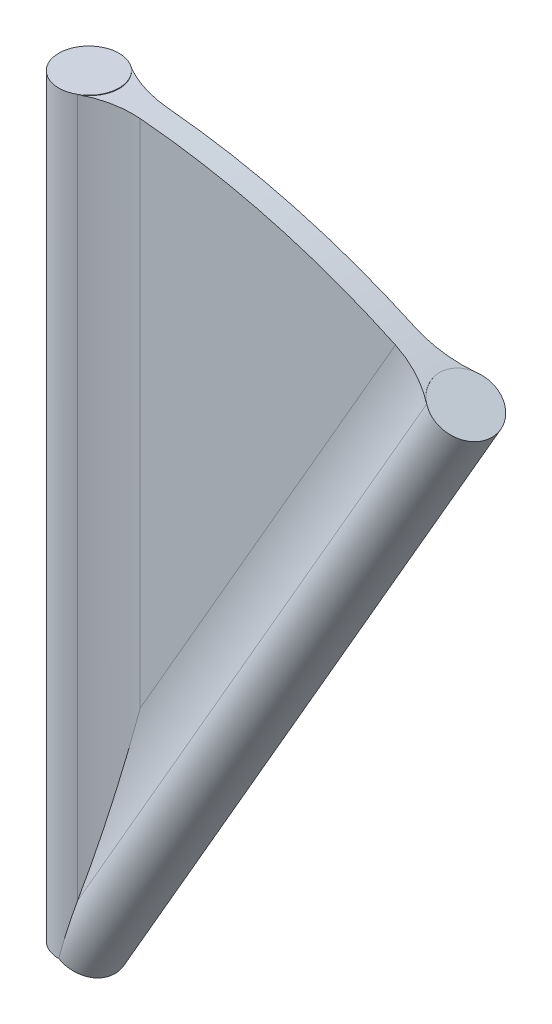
ISO-10303-21;
HEADER;
FILE_DESCRIPTION(('STEP AP214'),'2;1');
FILE_NAME('part.step','',(''),(''),'','','');
FILE_SCHEMA(('AUTOMOTIVE_DESIGN { 1 0 10303 214 1 1 1 1 }'));
ENDSEC;
DATA;
#1=APPLICATION_CONTEXT('core data for automotive mechanical design processes');
#2=APPLICATION_PROTOCOL_DEFINITION('international standard','automotive_design',2000,#1);
#3=PRODUCT_CONTEXT('',#1,'mechanical');
#4=PRODUCT('Part','Part','',(#3));
#5=PRODUCT_RELATED_PRODUCT_CATEGORY('part','',(#4));
#6=PRODUCT_DEFINITION_FORMATION('','',#4);
#7=PRODUCT_DEFINITION_CONTEXT('part definition',#1,'design');
#8=PRODUCT_DEFINITION('design','',#6,#7);
#9=PRODUCT_DEFINITION_SHAPE('','',#8);
#10=(LENGTH_UNIT() NAMED_UNIT(*) SI_UNIT(.MILLI.,.METRE.));
#11=(NAMED_UNIT(*) PLANE_ANGLE_UNIT() SI_UNIT($,.RADIAN.));
#12=(NAMED_UNIT(*) SI_UNIT($,.STERADIAN.) SOLID_ANGLE_UNIT());
#13=UNCERTAINTY_MEASURE_WITH_UNIT(LENGTH_MEASURE(1.E-05),#10,'distance_accuracy_value','');
#14=(GEOMETRIC_REPRESENTATION_CONTEXT(3) GLOBAL_UNCERTAINTY_ASSIGNED_CONTEXT((#13)) GLOBAL_UNIT_ASSIGNED_CONTEXT((#10,
#11,#12)) REPRESENTATION_CONTEXT('',''));
#15=CARTESIAN_POINT('',(0.,0.,0.));
#16=DIRECTION('',(0.,0.,1.));
#17=DIRECTION('',(1.,0.,0.));
#18=AXIS2_PLACEMENT_3D('',#15,#16,#17);
#19=CARTESIAN_POINT('',(0.,19.05,0.));
#20=DIRECTION('',(0.,-1.,0.));
#21=DIRECTION('',(0.,0.,-1.));
#22=AXIS2_PLACEMENT_3D('',#19,#20,#21);
#23=CYLINDRICAL_SURFACE('',#22,0.762);
#24=CARTESIAN_POINT('',(0.,19.05,0.));
#25=DIRECTION('',(0.,1.,0.));
#26=DIRECTION('',(0.,0.,1.));
#27=AXIS2_PLACEMENT_3D('',#24,#25,#26);
#28=CIRCLE('',#27,0.762);
#29=CARTESIAN_POINT('',(0.,19.05,0.762));
#30=VERTEX_POINT('',#29);
#31=EDGE_CURVE('E98',#30,#30,#28,.T.);
#32=ORIENTED_EDGE('',*,*,#31,.F.);
#33=EDGE_LOOP('',(#32));
#34=FACE_BOUND('',#33,.T.);
#35=CARTESIAN_POINT('',(0.,19.05,-0.762));
#36=CARTESIAN_POINT('',(0.0427835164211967,19.0499997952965,-0.76199810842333));
#37=CARTESIAN_POINT('',(0.0855976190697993,19.0498543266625,-0.758384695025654));
#38=CARTESIAN_POINT('',(0.170045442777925,19.0492880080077,-0.744020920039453));
#39=CARTESIAN_POINT('',(0.211677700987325,19.0488668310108,-0.73326208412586));
#40=CARTESIAN_POINT('',(0.292526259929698,19.0477967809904,-0.704915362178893));
#41=CARTESIAN_POINT('',(0.331743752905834,19.0471480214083,-0.687330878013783));
#42=CARTESIAN_POINT('',(0.40665943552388,19.0456959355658,-0.645837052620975));
#43=CARTESIAN_POINT('',(0.442358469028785,19.0448926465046,-0.621929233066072));
#44=CARTESIAN_POINT('',(0.509259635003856,19.0432212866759,-0.568448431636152));
#45=CARTESIAN_POINT('',(0.540459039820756,19.0423531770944,-0.538872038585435));
#46=CARTESIAN_POINT('',(0.597452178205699,19.0406503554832,-0.474900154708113));
#47=CARTESIAN_POINT('',(0.623245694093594,19.0398156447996,-0.440504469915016));
#48=CARTESIAN_POINT('',(0.668701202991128,19.0382735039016,-0.367857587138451));
#49=CARTESIAN_POINT('',(0.688361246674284,19.0375661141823,-0.329605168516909));
#50=CARTESIAN_POINT('',(0.720979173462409,19.0363588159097,-0.250339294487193));
#51=CARTESIAN_POINT('',(0.733937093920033,19.0358589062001,-0.20932585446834));
#52=CARTESIAN_POINT('',(0.752776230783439,19.0351232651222,-0.125725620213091));
#53=CARTESIAN_POINT('',(0.758661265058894,19.0348873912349,-0.0831396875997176));
#54=CARTESIAN_POINT('',(0.7631993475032,19.0347059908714,0.00241623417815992));
#55=CARTESIAN_POINT('',(0.761852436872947,19.0347604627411,0.0453862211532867));
#56=CARTESIAN_POINT('',(0.751968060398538,19.0351534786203,0.130464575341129));
#57=CARTESIAN_POINT('',(0.743434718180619,19.0354918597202,0.172573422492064));
#58=CARTESIAN_POINT('',(0.719426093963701,19.0364142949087,0.254760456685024));
#59=CARTESIAN_POINT('',(0.703950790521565,19.0369983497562,0.294838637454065));
#60=CARTESIAN_POINT('',(0.666492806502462,19.0383464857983,0.37183995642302));
#61=CARTESIAN_POINT('',(0.644508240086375,19.0391106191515,0.408762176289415));
#62=CARTESIAN_POINT('',(0.59465717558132,19.0407327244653,0.478393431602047));
#63=CARTESIAN_POINT('',(0.566790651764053,19.0415906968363,0.511102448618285));
#64=CARTESIAN_POINT('',(0.505943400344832,19.0433044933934,0.571402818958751));
#65=CARTESIAN_POINT('',(0.472959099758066,19.0441603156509,0.598990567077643));
#66=CARTESIAN_POINT('',(0.402825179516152,19.0457727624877,0.648237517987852));
#67=CARTESIAN_POINT('',(0.365675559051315,19.0465293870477,0.669896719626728));
#68=CARTESIAN_POINT('',(0.288263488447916,19.0478581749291,0.706671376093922));
#69=CARTESIAN_POINT('',(0.2480009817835,19.0484303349,0.721786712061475));
#70=CARTESIAN_POINT('',(0.165506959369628,19.0493256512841,0.745042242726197));
#71=CARTESIAN_POINT('',(0.123275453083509,19.049648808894,0.753182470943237));
#72=CARTESIAN_POINT('',(0.0380735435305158,19.0500095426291,0.762252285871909));
#73=CARTESIAN_POINT('',(-0.00489632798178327,19.0500473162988,0.763186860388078));
#74=CARTESIAN_POINT('',(-0.0903827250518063,19.0498335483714,0.757831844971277));
#75=CARTESIAN_POINT('',(-0.132899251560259,19.049582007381,0.751542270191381));
#76=CARTESIAN_POINT('',(-0.216258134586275,19.0488180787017,0.731921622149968));
#77=CARTESIAN_POINT('',(-0.257101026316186,19.0483057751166,0.718592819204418));
#78=CARTESIAN_POINT('',(-0.335969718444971,19.0470780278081,0.685274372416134));
#79=CARTESIAN_POINT('',(-0.373995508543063,19.0463625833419,0.665284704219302));
#80=CARTESIAN_POINT('',(-0.446173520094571,19.0448086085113,0.619199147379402));
#81=CARTESIAN_POINT('',(-0.480323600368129,19.0439700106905,0.593099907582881));
#82=CARTESIAN_POINT('',(-0.543759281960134,19.0422644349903,0.535540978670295));
#83=CARTESIAN_POINT('',(-0.573044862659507,19.0413974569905,0.504081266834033));
#84=CARTESIAN_POINT('',(-0.625936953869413,19.0397322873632,0.436673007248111));
#85=CARTESIAN_POINT('',(-0.649540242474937,19.038934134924,0.400721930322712));
#86=CARTESIAN_POINT('',(-0.690375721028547,19.0374972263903,0.3253642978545));
#87=CARTESIAN_POINT('',(-0.70760793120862,19.0368584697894,0.285957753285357));
#88=CARTESIAN_POINT('',(-0.735206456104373,19.0358126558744,0.204819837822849));
#89=CARTESIAN_POINT('',(-0.74557484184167,19.0354055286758,0.163089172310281));
#90=CARTESIAN_POINT('',(-0.75915817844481,19.0348686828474,0.0784776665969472));
#91=CARTESIAN_POINT('',(-0.762373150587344,19.0347389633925,0.0355968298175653));
#92=CARTESIAN_POINT('',(-0.761558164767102,19.0347715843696,-0.0500656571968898));
#93=CARTESIAN_POINT('',(-0.757533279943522,19.0349337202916,-0.0928473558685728));
#94=CARTESIAN_POINT('',(-0.74236329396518,19.0355313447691,-0.177127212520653));
#95=CARTESIAN_POINT('',(-0.731218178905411,19.0359668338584,-0.218625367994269));
#96=CARTESIAN_POINT('',(-0.702125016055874,19.0370620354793,-0.299161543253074));
#97=CARTESIAN_POINT('',(-0.684176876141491,19.0377217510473,-0.338199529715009));
#98=CARTESIAN_POINT('',(-0.641988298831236,19.0391910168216,-0.412707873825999));
#99=CARTESIAN_POINT('',(-0.617748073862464,19.0400005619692,-0.448178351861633));
#100=CARTESIAN_POINT('',(-0.563646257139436,19.0416788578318,-0.514569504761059));
#101=CARTESIAN_POINT('',(-0.533781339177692,19.0425476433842,-0.545487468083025));
#102=CARTESIAN_POINT('',(-0.46927613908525,19.0442463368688,-0.601879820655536));
#103=CARTESIAN_POINT('',(-0.434634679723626,19.0450762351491,-0.627352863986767));
#104=CARTESIAN_POINT('',(-0.361540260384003,19.0466040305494,-0.672139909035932));
#105=CARTESIAN_POINT('',(-0.323084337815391,19.0473018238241,-0.691449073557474));
#106=CARTESIAN_POINT('',(-0.243502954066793,19.0484850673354,-0.723314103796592));
#107=CARTESIAN_POINT('',(-0.202380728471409,19.0489707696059,-0.73587798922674));
#108=CARTESIAN_POINT('',(-0.13416715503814,19.0495458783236,-0.750581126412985));
#109=CARTESIAN_POINT('',(-0.10751817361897,19.0497154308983,-0.754857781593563));
#110=CARTESIAN_POINT('',(-0.0539168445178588,19.0499425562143,-0.760567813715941));
#111=CARTESIAN_POINT('',(-0.0269644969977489,19.0500001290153,-0.76200119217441));
#112=CARTESIAN_POINT('',(0.,19.05,-0.762));
#113=B_SPLINE_CURVE_WITH_KNOTS('',3,(#35,#36,#37,#38,#39,#40,#41,#42,#43,#44,#45,#46,#47,#48,
#49,#50,#51,#52,#53,#54,#55,#56,#57,#58,#59,#60,#61,#62,#63,#64,#65,#66,#67,#68,#69,#70,#71,#72,
#73,#74,#75,#76,#77,#78,#79,#80,#81,#82,#83,#84,#85,#86,#87,#88,#89,#90,#91,#92,#93,#94,#95,#96,
#97,#98,#99,#100,#101,#102,#103,#104,#105,#106,#107,#108,#109,#110,#111,#112),.UNSPECIFIED.,.T.,
.F.,(4,2,2,2,2,2,2,2,2,2,2,2,2,2,2,2,2,2,2,2,2,2,2,2,2,2,2,2,2,2,2,2,2,2,2,2,2,2,4),(0.,
0.128252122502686,0.256656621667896,0.384997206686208,0.513306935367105,0.641694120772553,
0.770086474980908,0.898519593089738,1.02695199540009,1.15531504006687,1.28367735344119,
1.4119660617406,1.5402551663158,1.66858147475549,1.79690834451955,1.9253252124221,
2.05374210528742,2.18216133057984,2.31057993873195,2.43890964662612,2.56723908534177,
2.69552716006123,2.8238157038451,2.95217478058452,3.08053440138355,3.20896663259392,
3.3373984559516,3.46579150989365,3.59418418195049,3.72248692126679,3.85078991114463,
3.97909463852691,4.10739503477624,4.23577154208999,4.36417974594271,4.49268847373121,
4.62104407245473,4.70187557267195,4.78270702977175),.UNSPECIFIED.);
#114=CARTESIAN_POINT('',(0.404575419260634,19.0457034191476,-0.645726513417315));
#115=VERTEX_POINT('',#114);
#116=CARTESIAN_POINT('',(0.376045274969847,19.0462880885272,0.662747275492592));
#117=VERTEX_POINT('',#116);
#118=EDGE_CURVE('E51',#115,#117,#113,.T.);
#119=ORIENTED_EDGE('',*,*,#118,.F.);
#120=DIRECTION('',(0.,-1.,0.));
#121=VECTOR('',#120,1.);
#122=CARTESIAN_POINT('',(0.404575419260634,19.05,-0.645726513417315));
#123=LINE('',#122,#121);
#124=CARTESIAN_POINT('',(0.404575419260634,1.50989602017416,-0.645726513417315));
#125=VERTEX_POINT('',#124);
#126=EDGE_CURVE('E103',#115,#125,#123,.T.);
#127=ORIENTED_EDGE('',*,*,#126,.T.);
#128=CARTESIAN_POINT('',(0.,0.,0.));
#129=DIRECTION('',(0.965925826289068,-0.258819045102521,0.));
#130=DIRECTION('',(-0.258819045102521,-0.965925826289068,0.));
#131=AXIS2_PLACEMENT_3D('',#128,#129,#130);
#132=ELLIPSE('',#131,2.94414191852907,0.762);
#133=CARTESIAN_POINT('',(0.,0.,-0.762));
#134=VERTEX_POINT('',#133);
#135=EDGE_CURVE('E99',#134,#125,#132,.T.);
#136=ORIENTED_EDGE('',*,*,#135,.F.);
#137=CARTESIAN_POINT('',(0.,0.,0.));
#138=DIRECTION('',(0.,1.,0.));
#139=DIRECTION('',(0.,0.,1.));
#140=AXIS2_PLACEMENT_3D('',#137,#138,#139);
#141=CIRCLE('',#140,0.762);
#142=CARTESIAN_POINT('',(0.,0.,0.762));
#143=VERTEX_POINT('',#142);
#144=EDGE_CURVE('E91',#134,#143,#141,.T.);
#145=ORIENTED_EDGE('',*,*,#144,.T.);
#146=CARTESIAN_POINT('',(0.376045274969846,1.40342007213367,0.662747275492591));
#147=VERTEX_POINT('',#146);
#148=EDGE_CURVE('E108',#147,#143,#132,.T.);
#149=ORIENTED_EDGE('',*,*,#148,.F.);
#150=DIRECTION('',(0.,-1.,0.));
#151=VECTOR('',#150,1.);
#152=CARTESIAN_POINT('',(0.376045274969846,19.05,0.662747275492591));
#153=LINE('',#152,#151);
#154=EDGE_CURVE('E141',#147,#117,#153,.F.);
#155=ORIENTED_EDGE('',*,*,#154,.T.);
#156=EDGE_LOOP('',(#119,#127,#136,#145,#149,#155));
#157=FACE_BOUND('',#156,.T.);
#158=ADVANCED_FACE('F31',(#34,#157),#23,.T.);
#159=CARTESIAN_POINT('',(9.52500000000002,16.4977839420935,0.));
#160=DIRECTION('',(-0.500000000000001,-0.866025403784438,0.));
#161=DIRECTION('',(0.866025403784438,-0.500000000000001,0.));
#162=AXIS2_PLACEMENT_3D('',#159,#160,#161);
#163=CYLINDRICAL_SURFACE('',#162,0.762);
#164=CARTESIAN_POINT('',(9.52500000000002,16.4977839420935,0.));
#165=DIRECTION('',(0.500000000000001,0.866025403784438,0.));
#166=DIRECTION('',(-0.866025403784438,0.500000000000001,0.));
#167=AXIS2_PLACEMENT_3D('',#164,#165,#166);
#168=CIRCLE('',#167,0.762);
#169=CARTESIAN_POINT('',(8.86508864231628,16.8787839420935,0.));
#170=VERTEX_POINT('',#169);
#171=EDGE_CURVE('E116',#170,#170,#168,.T.);
#172=ORIENTED_EDGE('',*,*,#171,.F.);
#173=EDGE_LOOP('',(#172));
#174=FACE_BOUND('',#173,.T.);
#175=CARTESIAN_POINT('',(10.1772883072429,16.1035804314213,0.));
#176=CARTESIAN_POINT('',(10.1772867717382,16.1035815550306,0.0427835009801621));
#177=CARTESIAN_POINT('',(10.174230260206,16.1055143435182,0.0855975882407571));
#178=CARTESIAN_POINT('',(10.1620742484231,16.1131870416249,0.170045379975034));
#179=CARTESIAN_POINT('',(10.1529675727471,16.1189314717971,0.211677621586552));
#180=CARTESIAN_POINT('',(10.1289539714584,16.1340320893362,0.292526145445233));
#181=CARTESIAN_POINT('',(10.1140499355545,16.1433864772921,0.331743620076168));
#182=CARTESIAN_POINT('',(10.0788416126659,16.1653914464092,0.406659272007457));
#183=CARTESIAN_POINT('',(10.0585386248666,16.1780412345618,0.442358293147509));
#184=CARTESIAN_POINT('',(10.0130587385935,16.2062293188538,0.509259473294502));
#185=CARTESIAN_POINT('',(9.98787890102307,16.2217693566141,0.540458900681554));
#186=CARTESIAN_POINT('',(9.93332894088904,16.2552298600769,0.597452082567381));
#187=CARTESIAN_POINT('',(9.90395864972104,16.2731504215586,0.623245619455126));
#188=CARTESIAN_POINT('',(9.84181539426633,16.3108089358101,0.668701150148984));
#189=CARTESIAN_POINT('',(9.8090413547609,16.3305474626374,0.688361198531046));
#190=CARTESIAN_POINT('',(9.74099840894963,16.3712253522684,0.72097913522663));
#191=CARTESIAN_POINT('',(9.70572951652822,16.3921647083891,0.733937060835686));
#192=CARTESIAN_POINT('',(9.63369715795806,16.4346014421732,0.752776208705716));
#193=CARTESIAN_POINT('',(9.59693450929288,16.4560985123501,0.758661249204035));
#194=CARTESIAN_POINT('',(9.52293155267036,16.4990334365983,0.763199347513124));
#195=CARTESIAN_POINT('',(9.48569124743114,16.5204712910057,0.761852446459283));
#196=CARTESIAN_POINT('',(9.41181483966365,16.5626703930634,0.751968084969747));
#197=CARTESIAN_POINT('',(9.37517840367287,16.5834320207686,0.743434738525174));
#198=CARTESIAN_POINT('',(9.30354135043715,16.623727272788,0.719426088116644));
#199=CARTESIAN_POINT('',(9.26854073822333,16.6432608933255,0.703950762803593));
#200=CARTESIAN_POINT('',(9.20118185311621,16.6805946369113,0.666492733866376));
#201=CARTESIAN_POINT('',(9.1688243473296,16.6983942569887,0.644508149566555));
#202=CARTESIAN_POINT('',(9.10771105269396,16.7318054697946,0.594657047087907));
#203=CARTESIAN_POINT('',(9.07895527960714,16.7474170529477,0.566790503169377));
#204=CARTESIAN_POINT('',(9.02587674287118,16.7760830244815,0.505943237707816));
#205=CARTESIAN_POINT('',(9.00155709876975,16.7891356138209,0.472958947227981));
#206=CARTESIAN_POINT('',(8.95810158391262,16.8123622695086,0.402825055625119));
#207=CARTESIAN_POINT('',(8.93896571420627,16.8225363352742,0.365675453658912));
#208=CARTESIAN_POINT('',(8.9064532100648,16.8397723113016,0.28826338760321));
#209=CARTESIAN_POINT('',(8.89307668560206,16.8468341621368,0.248000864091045));
#210=CARTESIAN_POINT('',(8.87248884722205,16.8576860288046,0.165506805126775));
#211=CARTESIAN_POINT('',(8.86527750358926,16.8614760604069,0.123275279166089));
#212=CARTESIAN_POINT('',(8.85724232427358,16.865698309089,0.0380733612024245));
#213=CARTESIAN_POINT('',(8.85641406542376,16.8661328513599,-0.0048964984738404));
#214=CARTESIAN_POINT('',(8.86115862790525,16.8636406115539,-0.0903828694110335));
#215=CARTESIAN_POINT('',(8.86673143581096,16.860713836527,-0.132899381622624));
#216=CARTESIAN_POINT('',(8.8841056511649,16.8515655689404,-0.216258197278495));
#217=CARTESIAN_POINT('',(8.89590504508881,16.8453451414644,-0.257101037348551));
#218=CARTESIAN_POINT('',(8.92537384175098,16.8297497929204,-0.335969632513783));
#219=CARTESIAN_POINT('',(8.94304326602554,16.8203748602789,-0.373995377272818));
#220=CARTESIAN_POINT('',(8.98373173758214,16.7986783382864,-0.446173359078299));
#221=CARTESIAN_POINT('',(9.00675372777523,16.7863551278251,-0.480323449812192));
#222=CARTESIAN_POINT('',(9.0574540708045,16.759052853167,-0.543759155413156));
#223=CARTESIAN_POINT('',(9.08513244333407,16.7440737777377,-0.573044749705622));
#224=CARTESIAN_POINT('',(9.14434214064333,16.7118114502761,-0.625936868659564));
#225=CARTESIAN_POINT('',(9.17587563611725,16.6945268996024,-0.649540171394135));
#226=CARTESIAN_POINT('',(9.24185541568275,16.6580919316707,-0.69037567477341));
#227=CARTESIAN_POINT('',(9.27630169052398,16.6389415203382,-0.707607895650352));
#228=CARTESIAN_POINT('',(9.34709175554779,16.5992776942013,-0.735206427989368));
#229=CARTESIAN_POINT('',(9.38343496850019,16.5787646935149,-0.745574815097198));
#230=CARTESIAN_POINT('',(9.45697886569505,16.5369235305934,-0.759158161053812));
#231=CARTESIAN_POINT('',(9.49417954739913,16.5155953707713,-0.762373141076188));
#232=CARTESIAN_POINT('',(9.56834915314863,16.4727358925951,-0.761558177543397));
#233=CARTESIAN_POINT('',(9.60531822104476,16.4512047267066,-0.757533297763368));
#234=CARTESIAN_POINT('',(9.67800819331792,16.4085475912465,-0.742363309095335));
#235=CARTESIAN_POINT('',(9.71372909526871,16.3874216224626,-0.731218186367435));
#236=CARTESIAN_POINT('',(9.78292826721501,16.3462056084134,-0.702124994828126));
#237=CARTESIAN_POINT('',(9.81640650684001,16.3261155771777,-0.684176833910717));
#238=CARTESIAN_POINT('',(9.88019834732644,16.2875894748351,-0.641988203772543));
#239=CARTESIAN_POINT('',(9.91051205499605,16.2691533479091,-0.617747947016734));
#240=CARTESIAN_POINT('',(9.96716946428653,16.2345045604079,-0.563646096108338));
#241=CARTESIAN_POINT('',(9.9935108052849,16.2182932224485,-0.533781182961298));
#242=CARTESIAN_POINT('',(10.0414985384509,16.1886258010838,-0.469276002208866));
#243=CARTESIAN_POINT('',(10.0631437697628,16.1751703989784,-0.434634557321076));
#244=CARTESIAN_POINT('',(10.1011662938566,16.1514532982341,-0.361540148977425));
#245=CARTESIAN_POINT('',(10.1175394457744,16.1411941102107,-0.323084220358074));
#246=CARTESIAN_POINT('',(10.1445433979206,16.1242362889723,-0.243502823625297));
#247=CARTESIAN_POINT('',(10.1551810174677,16.1175334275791,-0.202380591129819));
#248=CARTESIAN_POINT('',(10.167626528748,16.1096834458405,-0.134167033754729));
#249=CARTESIAN_POINT('',(10.1712453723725,16.1073981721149,-0.107518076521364));
#250=CARTESIAN_POINT('',(10.1760767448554,16.1043463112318,-0.0539167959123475));
#251=CARTESIAN_POINT('',(10.1772892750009,16.1035797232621,-0.0269644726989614));
#252=CARTESIAN_POINT('',(10.1772883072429,16.1035804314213,0.));
#253=B_SPLINE_CURVE_WITH_KNOTS('',3,(#175,#176,#177,#178,#179,#180,#181,#182,#183,#184,#185,
#186,#187,#188,#189,#190,#191,#192,#193,#194,#195,#196,#197,#198,#199,#200,#201,#202,#203,#204,
#205,#206,#207,#208,#209,#210,#211,#212,#213,#214,#215,#216,#217,#218,#219,#220,#221,#222,#223,
#224,#225,#226,#227,#228,#229,#230,#231,#232,#233,#234,#235,#236,#237,#238,#239,#240,#241,#242,
#243,#244,#245,#246,#247,#248,#249,#250,#251,#252),.UNSPECIFIED.,.T.,.F.,(4,2,2,2,2,2,2,2,2,2,2,
2,2,2,2,2,2,2,2,2,2,2,2,2,2,2,2,2,2,2,2,2,2,2,2,2,2,2,4),(0.,0.128252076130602,
0.256656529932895,0.384997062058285,0.513306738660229,0.641693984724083,0.770086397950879,
0.898519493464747,1.02695187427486,1.15531489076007,1.28367717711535,1.41196603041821,
1.54025527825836,1.66858162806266,1.7969085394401,1.92532534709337,2.05374218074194,
2.18216146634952,2.31058013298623,2.43890980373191,2.56723920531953,2.69552713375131,
2.82381553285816,2.95217463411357,3.08053427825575,3.20896653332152,3.33739838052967,
3.46579137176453,3.59418398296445,3.7224868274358,3.85078992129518,3.97909475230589,
4.10739525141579,4.23577169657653,4.36417983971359,4.49268859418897,4.62104421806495,
4.70187564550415,4.78270702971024),.UNSPECIFIED.);
#254=CARTESIAN_POINT('',(9.19747928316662,16.6825919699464,0.662747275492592));
#255=VERTEX_POINT('',#254);
#256=CARTESIAN_POINT('',(9.17247911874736,16.6963507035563,-0.645726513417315));
#257=VERTEX_POINT('',#256);
#258=EDGE_CURVE('E120',#255,#257,#253,.T.);
#259=ORIENTED_EDGE('',*,*,#258,.F.);
#260=DIRECTION('',(-0.500000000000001,-0.866025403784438,0.));
#261=VECTOR('',#260,1.);
#262=CARTESIAN_POINT('',(9.19933523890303,16.6858065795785,0.662747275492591));
#263=LINE('',#262,#261);
#264=EDGE_CURVE('E134',#255,#147,#263,.T.);
#265=ORIENTED_EDGE('',*,*,#264,.T.);
#266=ORIENTED_EDGE('',*,*,#148,.T.);
#267=CARTESIAN_POINT('',(0.,0.,0.));
#268=DIRECTION('',(0.500000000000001,0.866025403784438,0.));
#269=DIRECTION('',(-0.866025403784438,0.500000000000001,0.));
#270=AXIS2_PLACEMENT_3D('',#267,#268,#269);
#271=CIRCLE('',#270,0.762);
#272=EDGE_CURVE('E112',#143,#134,#271,.T.);
#273=ORIENTED_EDGE('',*,*,#272,.T.);
#274=ORIENTED_EDGE('',*,*,#135,.T.);
#275=DIRECTION('',(-0.500000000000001,-0.866025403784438,0.));
#276=VECTOR('',#275,1.);
#277=CARTESIAN_POINT('',(9.17462740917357,16.7000716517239,-0.645726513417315));
#278=LINE('',#277,#276);
#279=EDGE_CURVE('E132',#125,#257,#278,.F.);
#280=ORIENTED_EDGE('',*,*,#279,.T.);
#281=EDGE_LOOP('',(#259,#265,#266,#273,#274,#280));
#282=FACE_BOUND('',#281,.T.);
#283=ADVANCED_FACE('F115',(#174,#282),#163,.T.);
#284=CARTESIAN_POINT('',(0.,0.,0.));
#285=DIRECTION('',(0.,1.,0.));
#286=DIRECTION('',(0.,0.,1.));
#287=AXIS2_PLACEMENT_3D('',#284,#285,#286);
#288=PLANE('',#287);
#289=DIRECTION('',(0.,0.,-1.));
#290=VECTOR('',#289,1.);
#291=CARTESIAN_POINT('',(0.,0.,0.));
#292=LINE('',#291,#290);
#293=EDGE_CURVE('E95',#143,#134,#292,.T.);
#294=ORIENTED_EDGE('',*,*,#293,.F.);
#295=ORIENTED_EDGE('',*,*,#144,.F.);
#296=EDGE_LOOP('',(#294,#295));
#297=FACE_BOUND('',#296,.T.);
#298=ADVANCED_FACE('F93',(#297),#288,.F.);
#299=CARTESIAN_POINT('',(0.,19.05,0.));
#300=DIRECTION('',(0.,1.,0.));
#301=DIRECTION('',(0.,0.,1.));
#302=AXIS2_PLACEMENT_3D('',#299,#300,#301);
#303=PLANE('',#302);
#304=ORIENTED_EDGE('',*,*,#31,.T.);
#305=EDGE_LOOP('',(#304));
#306=FACE_BOUND('',#305,.T.);
#307=ADVANCED_FACE('F192',(#306),#303,.T.);
#308=CARTESIAN_POINT('',(0.,0.,0.));
#309=DIRECTION('',(0.500000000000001,0.866025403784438,0.));
#310=DIRECTION('',(-0.866025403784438,0.500000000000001,0.));
#311=AXIS2_PLACEMENT_3D('',#308,#309,#310);
#312=PLANE('',#311);
#313=ORIENTED_EDGE('',*,*,#272,.F.);
#314=ORIENTED_EDGE('',*,*,#293,.T.);
#315=EDGE_LOOP('',(#313,#314));
#316=FACE_BOUND('',#315,.T.);
#317=ADVANCED_FACE('F111',(#316),#312,.F.);
#318=CARTESIAN_POINT('',(9.52500000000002,16.4977839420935,0.));
#319=DIRECTION('',(0.500000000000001,0.866025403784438,0.));
#320=DIRECTION('',(-0.866025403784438,0.500000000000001,0.));
#321=AXIS2_PLACEMENT_3D('',#318,#319,#320);
#322=PLANE('',#321);
#323=ORIENTED_EDGE('',*,*,#171,.T.);
#324=EDGE_LOOP('',(#323));
#325=FACE_BOUND('',#324,.T.);
#326=ADVANCED_FACE('F175',(#325),#322,.T.);
#327=CARTESIAN_POINT('',(1.18982965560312,2.06084541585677,0.331904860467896));
#328=DIRECTION('',(0.,0.,-1.));
#329=DIRECTION('',(-1.,0.,0.));
#330=AXIS2_PLACEMENT_3D('',#327,#328,#329);
#331=PLANE('',#330);
#332=DIRECTION('',(0.,1.,0.));
#333=VECTOR('',#332,1.);
#334=CARTESIAN_POINT('',(1.62952952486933,2.55987990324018,0.331904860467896));
#335=LINE('',#334,#333);
#336=CARTESIAN_POINT('',(1.62952952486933,18.9801773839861,0.331904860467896));
#337=VERTEX_POINT('',#336);
#338=CARTESIAN_POINT('',(1.62952952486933,6.08148697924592,0.331904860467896));
#339=VERTEX_POINT('',#338);
#340=EDGE_CURVE('E113',#337,#339,#335,.F.);
#341=ORIENTED_EDGE('',*,*,#340,.T.);
#342=DIRECTION('',(0.500000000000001,0.866025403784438,0.));
#343=VECTOR('',#342,1.);
#344=CARTESIAN_POINT('',(8.10760971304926,17.3018510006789,0.331904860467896));
#345=LINE('',#344,#343);
#346=CARTESIAN_POINT('',(8.07887472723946,17.2520805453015,0.331904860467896));
#347=VERTEX_POINT('',#346);
#348=EDGE_CURVE('E129',#339,#347,#345,.T.);
#349=ORIENTED_EDGE('',*,*,#348,.T.);
#350=CARTESIAN_POINT('',(0.,0.,0.331904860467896));
#351=DIRECTION('',(0.,0.,1.));
#352=DIRECTION('',(1.,0.,0.));
#353=AXIS2_PLACEMENT_3D('',#350,#351,#352);
#354=CIRCLE('',#353,19.05);
#355=EDGE_CURVE('E204',#347,#337,#354,.T.);
#356=ORIENTED_EDGE('',*,*,#355,.T.);
#357=EDGE_LOOP('',(#341,#349,#356));
#358=FACE_BOUND('',#357,.T.);
#359=ADVANCED_FACE('F173',(#358),#331,.F.);
#360=CARTESIAN_POINT('',(0.,0.,-0.8382));
#361=DIRECTION('',(0.,0.,1.));
#362=DIRECTION('',(1.,0.,0.));
#363=AXIS2_PLACEMENT_3D('',#360,#361,#362);
#364=CYLINDRICAL_SURFACE('',#363,19.05);
#365=ORIENTED_EDGE('',*,*,#258,.T.);
#366=CARTESIAN_POINT('',(9.17247911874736,16.6963507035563,-0.645726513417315));
#367=CARTESIAN_POINT('',(9.11911119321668,16.7256724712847,-0.607573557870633));
#368=CARTESIAN_POINT('',(9.06417315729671,16.7555178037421,-0.572021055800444));
#369=CARTESIAN_POINT('',(8.95152674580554,16.8159664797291,-0.50633550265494));
#370=CARTESIAN_POINT('',(8.8938178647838,16.8465699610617,-0.47620344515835));
#371=CARTESIAN_POINT('',(8.7773834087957,16.9075208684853,-0.422223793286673));
#372=CARTESIAN_POINT('',(8.71871232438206,16.9378578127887,-0.398246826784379));
#373=CARTESIAN_POINT('',(8.59950659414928,16.9986902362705,-0.355848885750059));
#374=CARTESIAN_POINT('',(8.53897252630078,17.029185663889,-0.33742620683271));
#375=CARTESIAN_POINT('',(8.39515852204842,17.1006509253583,-0.300846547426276));
#376=CARTESIAN_POINT('',(8.31126625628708,17.1415880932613,-0.28499435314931));
#377=CARTESIAN_POINT('',(8.14046611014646,17.2233723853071,-0.263546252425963));
#378=CARTESIAN_POINT('',(8.05353147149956,17.2642076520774,-0.258118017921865));
#379=CARTESIAN_POINT('',(7.96629743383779,17.3043522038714,-0.258148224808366));
#380=B_SPLINE_CURVE_WITH_KNOTS('',3,(#366,#367,#368,#369,#370,#371,#372,#373,#374,#375,#376,
#377,#378,#379),.UNSPECIFIED.,.F.,.F.,(4,2,2,2,2,2,4),(0.,0.215507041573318,0.431053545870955,
0.641608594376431,0.852098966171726,1.13553803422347,1.42349930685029),.UNSPECIFIED.);
#381=CARTESIAN_POINT('',(7.96629743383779,17.3043522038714,-0.258148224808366));
#382=VERTEX_POINT('',#381);
#383=EDGE_CURVE('E151',#257,#382,#380,.T.);
#384=ORIENTED_EDGE('',*,*,#383,.T.);
#385=CARTESIAN_POINT('',(0.,0.,-0.258148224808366));
#386=DIRECTION('',(0.,0.,1.));
#387=DIRECTION('',(1.,0.,0.));
#388=AXIS2_PLACEMENT_3D('',#385,#386,#387);
#389=CIRCLE('',#388,19.05);
#390=CARTESIAN_POINT('',(1.75316015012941,18.9691573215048,-0.258148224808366));
#391=VERTEX_POINT('',#390);
#392=EDGE_CURVE('E207',#382,#391,#389,.T.);
#393=ORIENTED_EDGE('',*,*,#392,.T.);
#394=CARTESIAN_POINT('',(1.75316015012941,18.9691573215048,-0.258148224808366));
#395=CARTESIAN_POINT('',(1.68160692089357,18.9757744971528,-0.258140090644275));
#396=CARTESIAN_POINT('',(1.61001520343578,18.9819788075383,-0.261171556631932));
#397=CARTESIAN_POINT('',(1.46726049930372,18.9935445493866,-0.273275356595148));
#398=CARTESIAN_POINT('',(1.39609760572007,18.9989058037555,-0.282348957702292));
#399=CARTESIAN_POINT('',(1.25637468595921,19.008651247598,-0.306218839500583));
#400=CARTESIAN_POINT('',(1.18779255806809,19.013055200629,-0.320877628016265));
#401=CARTESIAN_POINT('',(1.05205661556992,19.0210489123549,-0.35582017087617));
#402=CARTESIAN_POINT('',(0.984902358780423,19.0246389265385,-0.376102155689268));
#403=CARTESIAN_POINT('',(0.82950533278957,19.0321401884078,-0.430161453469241));
#404=CARTESIAN_POINT('',(0.742017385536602,19.0357317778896,-0.466179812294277));
#405=CARTESIAN_POINT('',(0.570188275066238,19.0416646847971,-0.548385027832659));
#406=CARTESIAN_POINT('',(0.485919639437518,19.0439851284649,-0.594725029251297));
#407=CARTESIAN_POINT('',(0.404575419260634,19.0457034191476,-0.645726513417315));
#408=B_SPLINE_CURVE_WITH_KNOTS('',3,(#394,#395,#396,#397,#398,#399,#400,#401,#402,#403,#404,
#405,#406,#407),.UNSPECIFIED.,.F.,.F.,(4,2,2,2,2,2,4),(0.,0.215511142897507,0.4310674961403,
0.641628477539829,0.852123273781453,1.13554872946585,1.42349860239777),.UNSPECIFIED.);
#409=EDGE_CURVE('E44',#391,#115,#408,.T.);
#410=ORIENTED_EDGE('',*,*,#409,.T.);
#411=ORIENTED_EDGE('',*,*,#118,.T.);
#412=CARTESIAN_POINT('',(0.376045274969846,19.0462880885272,0.662747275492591));
#413=CARTESIAN_POINT('',(0.438442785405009,19.0450590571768,0.627333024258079));
#414=CARTESIAN_POINT('',(0.502343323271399,19.0434878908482,0.594580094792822));
#415=CARTESIAN_POINT('',(0.632684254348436,19.0396016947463,0.534590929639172));
#416=CARTESIAN_POINT('',(0.699125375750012,19.0372864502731,0.507356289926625));
#417=CARTESIAN_POINT('',(0.832602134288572,19.0319112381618,0.45913954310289));
#418=CARTESIAN_POINT('',(0.899594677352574,19.0288682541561,0.438036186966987));
#419=CARTESIAN_POINT('',(1.03502887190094,19.0219823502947,0.401462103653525));
#420=CARTESIAN_POINT('',(1.10346991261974,19.0181397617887,0.385989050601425));
#421=CARTESIAN_POINT('',(1.24738282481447,19.0092651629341,0.359661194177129));
#422=CARTESIAN_POINT('',(1.32294609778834,19.004158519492,0.349328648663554));
#423=CARTESIAN_POINT('',(1.47552621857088,18.9929276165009,0.335403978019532));
#424=CARTESIAN_POINT('',(1.55254967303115,18.9867919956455,0.331893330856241));
#425=CARTESIAN_POINT('',(1.62952952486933,18.9801773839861,0.331904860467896));
#426=B_SPLINE_CURVE_WITH_KNOTS('',3,(#412,#413,#414,#415,#416,#417,#418,#419,#420,#421,#422,
#423,#424,#425),.UNSPECIFIED.,.F.,.F.,(4,2,2,2,2,2,4),(0.,0.215206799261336,0.430475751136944,
0.641141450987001,0.851720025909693,1.08071547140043,1.31242953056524),.UNSPECIFIED.);
#427=EDGE_CURVE('E11',#117,#337,#426,.T.);
#428=ORIENTED_EDGE('',*,*,#427,.T.);
#429=ORIENTED_EDGE('',*,*,#355,.F.);
#430=CARTESIAN_POINT('',(8.07887472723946,17.2520805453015,0.331904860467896));
#431=CARTESIAN_POINT('',(8.14386142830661,17.2216528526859,0.331896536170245));
#432=CARTESIAN_POINT('',(8.20867330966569,17.1908503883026,0.334923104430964));
#433=CARTESIAN_POINT('',(8.33750974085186,17.128733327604,0.347006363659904));
#434=CARTESIAN_POINT('',(8.40153403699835,17.0974185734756,0.356064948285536));
#435=CARTESIAN_POINT('',(8.52695943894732,17.0352067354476,0.379914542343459));
#436=CARTESIAN_POINT('',(8.58838736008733,17.004315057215,0.394578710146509));
#437=CARTESIAN_POINT('',(8.70959354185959,16.9425530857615,0.429540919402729));
#438=CARTESIAN_POINT('',(8.76937248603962,16.9116827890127,0.449836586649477));
#439=CARTESIAN_POINT('',(8.89205431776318,16.8475238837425,0.497952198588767));
#440=CARTESIAN_POINT('',(8.95477345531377,16.8142597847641,0.526274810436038));
#441=CARTESIAN_POINT('',(9.07808118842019,16.7480130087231,0.58956814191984));
#442=CARTESIAN_POINT('',(9.13863561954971,16.7150383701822,0.624613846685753));
#443=CARTESIAN_POINT('',(9.19747928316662,16.6825919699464,0.662747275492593));
#444=B_SPLINE_CURVE_WITH_KNOTS('',3,(#430,#431,#432,#433,#434,#435,#436,#437,#438,#439,#440,
#441,#442,#443),.UNSPECIFIED.,.F.,.F.,(4,2,2,2,2,2,4),(0.,0.215208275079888,0.430484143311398,
0.641152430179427,0.8517320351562,1.08072048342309,1.31242942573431),.UNSPECIFIED.);
#445=EDGE_CURVE('E144',#347,#255,#444,.T.);
#446=ORIENTED_EDGE('',*,*,#445,.T.);
#447=EDGE_LOOP('',(#365,#384,#393,#410,#411,#428,#429,#446));
#448=FACE_BOUND('',#447,.T.);
#449=ADVANCED_FACE('F156',(#448),#364,.T.);
#450=CARTESIAN_POINT('',(1.18982965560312,2.06084541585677,-0.258148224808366));
#451=DIRECTION('',(0.,0.,1.));
#452=DIRECTION('',(1.,0.,0.));
#453=AXIS2_PLACEMENT_3D('',#450,#451,#452);
#454=PLANE('',#453);
#455=ORIENTED_EDGE('',*,*,#392,.F.);
#456=DIRECTION('',(0.500000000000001,0.866025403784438,0.));
#457=VECTOR('',#456,1.);
#458=CARTESIAN_POINT('',(-0.180452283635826,3.19376777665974,-0.258148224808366));
#459=LINE('',#458,#457);
#460=CARTESIAN_POINT('',(1.75316015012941,6.54288275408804,-0.258148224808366));
#461=VERTEX_POINT('',#460);
#462=EDGE_CURVE('E138',#382,#461,#459,.F.);
#463=ORIENTED_EDGE('',*,*,#462,.T.);
#464=DIRECTION('',(0.,1.,0.));
#465=VECTOR('',#464,1.);
#466=CARTESIAN_POINT('',(1.75316015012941,19.0365043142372,-0.258148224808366));
#467=LINE('',#466,#465);
#468=EDGE_CURVE('E136',#461,#391,#467,.T.);
#469=ORIENTED_EDGE('',*,*,#468,.T.);
#470=EDGE_LOOP('',(#455,#463,#469));
#471=FACE_BOUND('',#470,.T.);
#472=ADVANCED_FACE('F171',(#471),#454,.F.);
#473=CARTESIAN_POINT('',(1.62952952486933,19.05,2.8719048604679));
#474=DIRECTION('',(0.,-1.,0.));
#475=DIRECTION('',(0.,0.,-1.));
#476=AXIS2_PLACEMENT_3D('',#473,#474,#475);
#477=CYLINDRICAL_SURFACE('',#476,2.54);
#478=ORIENTED_EDGE('',*,*,#427,.F.);
#479=ORIENTED_EDGE('',*,*,#154,.F.);
#480=CARTESIAN_POINT('',(1.62952952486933,6.08148697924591,2.8719048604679));
#481=DIRECTION('',(-0.965925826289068,0.258819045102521,0.));
#482=DIRECTION('',(-0.258819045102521,-0.965925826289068,0.));
#483=AXIS2_PLACEMENT_3D('',#480,#481,#482);
#484=ELLIPSE('',#483,9.81380639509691,2.54);
#485=EDGE_CURVE('E210',#339,#147,#484,.T.);
#486=ORIENTED_EDGE('',*,*,#485,.F.);
#487=ORIENTED_EDGE('',*,*,#340,.F.);
#488=EDGE_LOOP('',(#478,#479,#486,#487));
#489=FACE_BOUND('',#488,.T.);
#490=ADVANCED_FACE('F165',(#489),#477,.F.);
#491=CARTESIAN_POINT('',(8.11378603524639,17.3125487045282,2.8719048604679));
#492=DIRECTION('',(-0.500000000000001,-0.866025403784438,0.));
#493=DIRECTION('',(0.866025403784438,-0.500000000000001,0.));
#494=AXIS2_PLACEMENT_3D('',#491,#492,#493);
#495=CYLINDRICAL_SURFACE('',#494,2.54);
#496=ORIENTED_EDGE('',*,*,#485,.T.);
#497=ORIENTED_EDGE('',*,*,#264,.F.);
#498=ORIENTED_EDGE('',*,*,#445,.F.);
#499=ORIENTED_EDGE('',*,*,#348,.F.);
#500=EDGE_LOOP('',(#496,#497,#498,#499));
#501=FACE_BOUND('',#500,.T.);
#502=ADVANCED_FACE('F160',(#501),#495,.F.);
#503=CARTESIAN_POINT('',(1.75316015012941,19.05,-2.79814822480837));
#504=DIRECTION('',(0.,-1.,0.));
#505=DIRECTION('',(0.,0.,-1.));
#506=AXIS2_PLACEMENT_3D('',#503,#504,#505);
#507=CYLINDRICAL_SURFACE('',#506,2.54);
#508=ORIENTED_EDGE('',*,*,#409,.F.);
#509=ORIENTED_EDGE('',*,*,#468,.F.);
#510=CARTESIAN_POINT('',(1.75316015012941,6.54288275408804,-2.79814822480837));
#511=DIRECTION('',(-0.965925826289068,0.258819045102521,0.));
#512=DIRECTION('',(-0.258819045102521,-0.965925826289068,0.));
#513=AXIS2_PLACEMENT_3D('',#510,#511,#512);
#514=ELLIPSE('',#513,9.81380639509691,2.54);
#515=EDGE_CURVE('E213',#125,#461,#514,.T.);
#516=ORIENTED_EDGE('',*,*,#515,.F.);
#517=ORIENTED_EDGE('',*,*,#126,.F.);
#518=EDGE_LOOP('',(#508,#509,#516,#517));
#519=FACE_BOUND('',#518,.T.);
#520=ADVANCED_FACE('F164',(#519),#507,.F.);
#521=CARTESIAN_POINT('',(8.00671877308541,17.3743640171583,-2.79814822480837));
#522=DIRECTION('',(-0.500000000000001,-0.866025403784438,0.));
#523=DIRECTION('',(0.866025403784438,-0.500000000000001,0.));
#524=AXIS2_PLACEMENT_3D('',#521,#522,#523);
#525=CYLINDRICAL_SURFACE('',#524,2.54);
#526=ORIENTED_EDGE('',*,*,#383,.F.);
#527=ORIENTED_EDGE('',*,*,#279,.F.);
#528=ORIENTED_EDGE('',*,*,#515,.T.);
#529=ORIENTED_EDGE('',*,*,#462,.F.);
#530=EDGE_LOOP('',(#526,#527,#528,#529));
#531=FACE_BOUND('',#530,.T.);
#532=ADVANCED_FACE('F219',(#531),#525,.F.);
#533=CLOSED_SHELL('',(#158,#283,#298,#307,#317,#326,#359,#449,#472,#490,#502,#520,#532));
#534=MANIFOLD_SOLID_BREP('B2',#533);
#535=ADVANCED_BREP_SHAPE_REPRESENTATION('',(#18,#534),#14);
#536=SHAPE_DEFINITION_REPRESENTATION(#9,#535);
ENDSEC;
END-ISO-10303-21;
